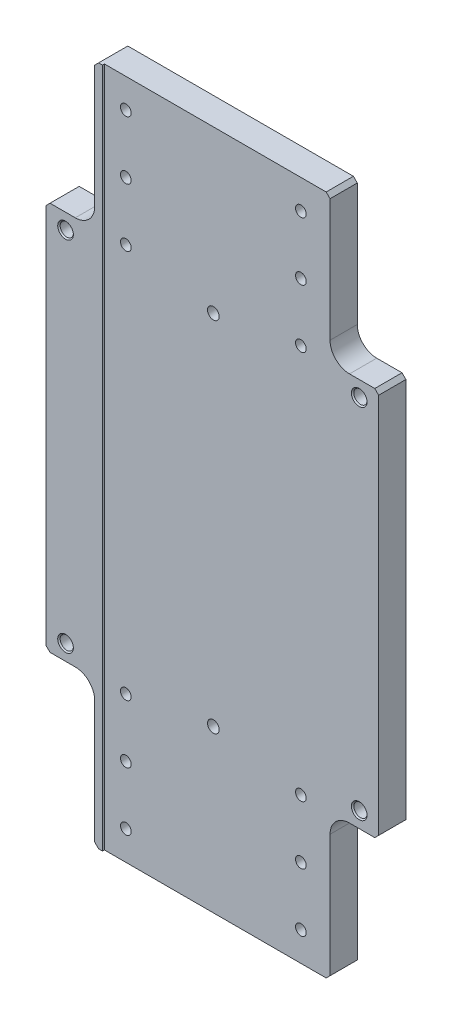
from build123d import *

# Parameters (mm, degrees)
EXTRUDE_1_DEPTH              = 7.5
SKETCH_2_W                   = 141
SKETCH_2_H                   = 350
CUT_EXTRUDE_1_DEPTH          = 1
HOLE_WIZARD_M5_1_D           = 5.5
HOLE_WIZARD_M5_1_CBORE_D     = 9.5
HOLE_WIZARD_M5_1_CBORE_DEPTH = 7
PATTERN_LINEAR_1_COUNT       = 2
PATTERN_LINEAR_1_PITCH       = 260
F_6_0MM_1_D                  = 6
FILLET_1_R                   = 10
CHAMFER_1_SIZE               = 2
HOLE_WIZARD_M8_2_AT_2_COUNT  = 2
HOLE_WIZARD_M8_2_AT_2_PITCH  = 184
HOLE_WIZARD_M8_3_AT_2_COUNT  = 2
HOLE_WIZARD_M8_3_AT_2_PITCH  = 184


with BuildPart() as part:
    # Sketch 1 → Extrude 1 (new, symmetric)
    with BuildSketch(Plane.XY):
        Polygon((60, 100), (85, 100), (85, -100), (60, -100), (60, -175), (-60, -175), (-60, -100), (-85, -100), (-85, 100), (-60, 100), (-60, 175), (60, 175), align=None)
    extrude(amount=EXTRUDE_1_DEPTH, both=True)

    # Sketch 2 → Cut-Extrude 1 (cut)
    with BuildSketch(Plane.XY.offset(7.5)):
        with Locations((14.5, 0)):
            Rectangle(SKETCH_2_W, SKETCH_2_H)
    extrude(amount=-CUT_EXTRUDE_1_DEPTH, mode=Mode.SUBTRACT)

    # Hole Wizard M5 _ _ _ _ _1 (through all)
    with Locations(Plane(origin=(0, 0, -7.5), x_dir=(-1, 0, 0), z_dir=(0, 0, -1))):
        with Locations((-45, 160), (45, 160), (-45, 130), (45, 130), (-45, 100), (45, 100)):
            hole_wizard_m5_1 = CounterBoreHole(HOLE_WIZARD_M5_1_D / 2, HOLE_WIZARD_M5_1_CBORE_D / 2, HOLE_WIZARD_M5_1_CBORE_DEPTH)

    # Pattern Linear 1: Hole Wizard M5 _ _ _ _ _1 ×2
    with Locations(*[(0, -i * PATTERN_LINEAR_1_PITCH, 0) for i in range(1, PATTERN_LINEAR_1_COUNT)]):
        add(hole_wizard_m5_1, mode=Mode.SUBTRACT)

    # 6.0mm _ _1 (through all)
    with Locations(Plane.XY.offset(6.5)):
        with Locations((0, -92), (0, 92)):
            Hole(F_6_0MM_1_D / 2)

    # Fillet 1
    fillet_1_edges = [part.edges().sort_by_distance(p)[0] for p in [
        (-60, -100, 0),
        (-60, 100, 0),
        (60, 100, -0.5),
        (60, -100, -0.5),
    ]]
    fillet(fillet_1_edges, radius=FILLET_1_R)

    # Chamfer 1
    chamfer_1_edges = [part.edges().sort_by_distance(p)[0] for p in [
        (-60, -175, 0),
        (-85, -100, 0),
        (-85, 100, 0),
        (-60, 175, 0),
        (60, -175, -0.5),
        (60, 175, -0.5),
        (85, 100, -0.5),
        (85, -100, -0.5),
    ]]
    chamfer(chamfer_1_edges, length=CHAMFER_1_SIZE)

    # Sketch 10 → Hole Wizard M8 _ _2 (revolve, cut)
    with BuildSketch(Plane(origin=(75, 92, 6.5), x_dir=(0, -1, 0), z_dir=(1, 0, 0))):
        Polygon((0, 0), (0, 14), (4.025, 14), (3.4, 13.375), (3.4, 0.625), (4.025, 0), align=None)
    hole_wizard_m8_2 = revolve(axis=Axis((75, 92, 12.85), (0, 0, -1)), mode=Mode.SUBTRACT)

    # Hole Wizard M8 _ _2 at 2: Hole Wizard M8 _ _2 ×2
    with Locations(*[(0, -i * HOLE_WIZARD_M8_2_AT_2_PITCH, 0) for i in range(1, HOLE_WIZARD_M8_2_AT_2_COUNT)]):
        add(hole_wizard_m8_2, mode=Mode.SUBTRACT)

    # Sketch 12 → Hole Wizard M8 _ _3 (revolve, cut)
    with BuildSketch(Plane(origin=(-75, 92, 7.5), x_dir=(0, -1, 0), z_dir=(1, 0, 0))):
        Polygon((0, 0), (0, 15), (4.025, 15), (3.4, 14.375), (3.4, 0.625), (4.025, 0), align=None)
    hole_wizard_m8_3 = revolve(axis=Axis((-75, 92, 13.85), (0, 0, -1)), mode=Mode.SUBTRACT)

    # Hole Wizard M8 _ _3 at 2: Hole Wizard M8 _ _3 ×2
    with Locations(*[(0, -i * HOLE_WIZARD_M8_3_AT_2_PITCH, 0) for i in range(1, HOLE_WIZARD_M8_3_AT_2_COUNT)]):
        add(hole_wizard_m8_3, mode=Mode.SUBTRACT)


solid = part.part
